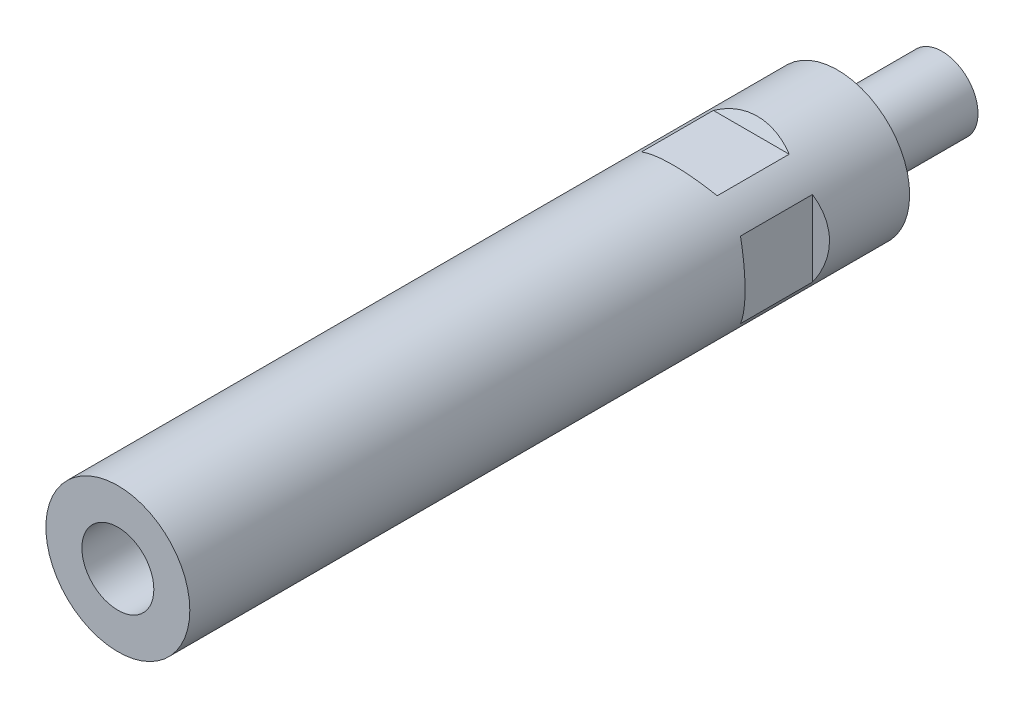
ISO-10303-21;
HEADER;
FILE_DESCRIPTION(('STEP AP214'),'2;1');
FILE_NAME('part.step','',(''),(''),'','','');
FILE_SCHEMA(('AUTOMOTIVE_DESIGN { 1 0 10303 214 1 1 1 1 }'));
ENDSEC;
DATA;
#1=APPLICATION_CONTEXT('core data for automotive mechanical design processes');
#2=APPLICATION_PROTOCOL_DEFINITION('international standard','automotive_design',2000,#1);
#3=PRODUCT_CONTEXT('',#1,'mechanical');
#4=PRODUCT('Part','Part','',(#3));
#5=PRODUCT_RELATED_PRODUCT_CATEGORY('part','',(#4));
#6=PRODUCT_DEFINITION_FORMATION('','',#4);
#7=PRODUCT_DEFINITION_CONTEXT('part definition',#1,'design');
#8=PRODUCT_DEFINITION('design','',#6,#7);
#9=PRODUCT_DEFINITION_SHAPE('','',#8);
#10=(LENGTH_UNIT() NAMED_UNIT(*) SI_UNIT(.MILLI.,.METRE.));
#11=(NAMED_UNIT(*) PLANE_ANGLE_UNIT() SI_UNIT($,.RADIAN.));
#12=(NAMED_UNIT(*) SI_UNIT($,.STERADIAN.) SOLID_ANGLE_UNIT());
#13=UNCERTAINTY_MEASURE_WITH_UNIT(LENGTH_MEASURE(1.E-05),#10,'distance_accuracy_value','');
#14=(GEOMETRIC_REPRESENTATION_CONTEXT(3) GLOBAL_UNCERTAINTY_ASSIGNED_CONTEXT((#13)) GLOBAL_UNIT_ASSIGNED_CONTEXT((#10,
#11,#12)) REPRESENTATION_CONTEXT('',''));
#15=CARTESIAN_POINT('',(0.,0.,0.));
#16=DIRECTION('',(0.,0.,1.));
#17=DIRECTION('',(1.,0.,0.));
#18=AXIS2_PLACEMENT_3D('',#15,#16,#17);
#19=CARTESIAN_POINT('',(0.,0.,5.5));
#20=DIRECTION('',(0.,0.,1.));
#21=DIRECTION('',(0.,-1.,0.));
#22=AXIS2_PLACEMENT_3D('',#19,#20,#21);
#23=CYLINDRICAL_SURFACE('',#22,5.);
#24=CARTESIAN_POINT('',(0.,0.,-14.5));
#25=DIRECTION('',(0.,0.,1.));
#26=DIRECTION('',(0.,-1.,0.));
#27=AXIS2_PLACEMENT_3D('',#24,#25,#26);
#28=CIRCLE('',#27,5.);
#29=CARTESIAN_POINT('',(0.,-5.,-14.5));
#30=VERTEX_POINT('',#29);
#31=EDGE_CURVE('E22',#30,#30,#28,.F.);
#32=ORIENTED_EDGE('',*,*,#31,.F.);
#33=EDGE_LOOP('',(#32));
#34=FACE_BOUND('',#33,.T.);
#35=CARTESIAN_POINT('',(0.,0.,0.));
#36=DIRECTION('',(0.,0.,1.));
#37=DIRECTION('',(1.,0.,0.));
#38=AXIS2_PLACEMENT_3D('',#35,#36,#37);
#39=CIRCLE('',#38,5.);
#40=CARTESIAN_POINT('',(5.,0.,0.));
#41=VERTEX_POINT('',#40);
#42=EDGE_CURVE('E9',#41,#41,#39,.T.);
#43=ORIENTED_EDGE('',*,*,#42,.F.);
#44=EDGE_LOOP('',(#43));
#45=FACE_BOUND('',#44,.T.);
#46=ADVANCED_FACE('F14',(#34,#45),#23,.T.);
#47=CARTESIAN_POINT('',(0.,0.,-14.5));
#48=DIRECTION('',(0.,0.,1.));
#49=DIRECTION('',(0.,-1.,0.));
#50=AXIS2_PLACEMENT_3D('',#47,#48,#49);
#51=PLANE('',#50);
#52=ORIENTED_EDGE('',*,*,#31,.T.);
#53=EDGE_LOOP('',(#52));
#54=FACE_BOUND('',#53,.T.);
#55=ADVANCED_FACE('F16',(#54),#51,.F.);
#56=CARTESIAN_POINT('',(4.25,4.36432032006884E-13,75.));
#57=DIRECTION('',(0.,0.,-1.));
#58=DIRECTION('',(-1.,0.,0.));
#59=AXIS2_PLACEMENT_3D('',#56,#57,#58);
#60=PLANE('',#59);
#61=CARTESIAN_POINT('',(0.,4.36432032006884E-13,75.));
#62=DIRECTION('',(0.,0.,1.));
#63=DIRECTION('',(1.,0.,0.));
#64=AXIS2_PLACEMENT_3D('',#61,#62,#63);
#65=CIRCLE('',#64,5.);
#66=CARTESIAN_POINT('',(5.,4.36432032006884E-13,75.));
#67=VERTEX_POINT('',#66);
#68=EDGE_CURVE('E251',#67,#67,#65,.T.);
#69=ORIENTED_EDGE('',*,*,#68,.T.);
#70=EDGE_LOOP('',(#69));
#71=FACE_BOUND('',#70,.T.);
#72=ADVANCED_FACE('F125',(#71),#60,.F.);
#73=CARTESIAN_POINT('',(0.,4.36432032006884E-13,100.));
#74=DIRECTION('',(0.,0.,1.));
#75=DIRECTION('',(1.,0.,0.));
#76=AXIS2_PLACEMENT_3D('',#73,#74,#75);
#77=CYLINDRICAL_SURFACE('',#76,5.);
#78=ORIENTED_EDGE('',*,*,#68,.F.);
#79=EDGE_LOOP('',(#78));
#80=FACE_BOUND('',#79,.T.);
#81=CARTESIAN_POINT('',(0.,4.36432032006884E-13,100.));
#82=DIRECTION('',(0.,0.,1.));
#83=DIRECTION('',(1.,0.,0.));
#84=AXIS2_PLACEMENT_3D('',#81,#82,#83);
#85=CIRCLE('',#84,5.);
#86=CARTESIAN_POINT('',(5.,4.36432032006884E-13,100.));
#87=VERTEX_POINT('',#86);
#88=EDGE_CURVE('E96',#87,#87,#85,.T.);
#89=ORIENTED_EDGE('',*,*,#88,.T.);
#90=EDGE_LOOP('',(#89));
#91=FACE_BOUND('',#90,.T.);
#92=ADVANCED_FACE('F127',(#80,#91),#77,.F.);
#93=CARTESIAN_POINT('',(0.,0.,100.));
#94=DIRECTION('',(0.,0.,1.));
#95=DIRECTION('',(1.,0.,0.));
#96=AXIS2_PLACEMENT_3D('',#93,#94,#95);
#97=PLANE('',#96);
#98=ORIENTED_EDGE('',*,*,#88,.F.);
#99=EDGE_LOOP('',(#98));
#100=FACE_BOUND('',#99,.T.);
#101=CARTESIAN_POINT('',(0.,0.,100.));
#102=DIRECTION('',(0.,0.,1.));
#103=DIRECTION('',(1.,0.,0.));
#104=AXIS2_PLACEMENT_3D('',#101,#102,#103);
#105=CIRCLE('',#104,10.);
#106=CARTESIAN_POINT('',(10.,0.,100.));
#107=VERTEX_POINT('',#106);
#108=EDGE_CURVE('E239',#107,#107,#105,.T.);
#109=ORIENTED_EDGE('',*,*,#108,.T.);
#110=EDGE_LOOP('',(#109));
#111=FACE_BOUND('',#110,.T.);
#112=ADVANCED_FACE('F134',(#100,#111),#97,.T.);
#113=CARTESIAN_POINT('',(8.5,-10.,22.));
#114=DIRECTION('',(-0.5,0.,0.866025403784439));
#115=DIRECTION('',(0.866025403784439,0.,0.5));
#116=AXIS2_PLACEMENT_3D('',#113,#114,#115);
#117=PLANE('',#116);
#118=DIRECTION('',(0.,1.,0.));
#119=VECTOR('',#118,1.);
#120=CARTESIAN_POINT('',(8.5,-10.,22.));
#121=LINE('',#120,#119);
#122=CARTESIAN_POINT('',(8.5,-5.26782687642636,22.));
#123=VERTEX_POINT('',#122);
#124=CARTESIAN_POINT('',(8.5,5.26782687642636,22.));
#125=VERTEX_POINT('',#124);
#126=EDGE_CURVE('E183',#123,#125,#121,.T.);
#127=ORIENTED_EDGE('',*,*,#126,.T.);
#128=CARTESIAN_POINT('',(0.,0.,17.0925227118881));
#129=DIRECTION('',(-0.5,0.,0.866025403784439));
#130=DIRECTION('',(-0.866025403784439,0.,-0.5));
#131=AXIS2_PLACEMENT_3D('',#128,#129,#130);
#132=ELLIPSE('',#131,11.5470053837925,10.);
#133=EDGE_CURVE('E35',#123,#125,#132,.T.);
#134=ORIENTED_EDGE('',*,*,#133,.F.);
#135=EDGE_LOOP('',(#127,#134));
#136=FACE_BOUND('',#135,.T.);
#137=ADVANCED_FACE('F175',(#136),#117,.F.);
#138=CARTESIAN_POINT('',(8.5,-10.,22.));
#139=DIRECTION('',(-1.,0.,0.));
#140=DIRECTION('',(0.,0.,1.));
#141=AXIS2_PLACEMENT_3D('',#138,#139,#140);
#142=PLANE('',#141);
#143=ORIENTED_EDGE('',*,*,#126,.F.);
#144=DIRECTION('',(0.,0.,-1.));
#145=VECTOR('',#144,1.);
#146=CARTESIAN_POINT('',(8.5,-5.26782687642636,100.));
#147=LINE('',#146,#145);
#148=CARTESIAN_POINT('',(8.5,-5.26782687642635,12.));
#149=VERTEX_POINT('',#148);
#150=EDGE_CURVE('E191',#149,#123,#147,.F.);
#151=ORIENTED_EDGE('',*,*,#150,.F.);
#152=DIRECTION('',(0.,1.,0.));
#153=VECTOR('',#152,1.);
#154=CARTESIAN_POINT('',(8.5,-10.,12.));
#155=LINE('',#154,#153);
#156=CARTESIAN_POINT('',(8.5,5.26782687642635,12.));
#157=VERTEX_POINT('',#156);
#158=EDGE_CURVE('E187',#149,#157,#155,.T.);
#159=ORIENTED_EDGE('',*,*,#158,.T.);
#160=DIRECTION('',(0.,0.,-1.));
#161=VECTOR('',#160,1.);
#162=CARTESIAN_POINT('',(8.5,5.26782687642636,100.));
#163=LINE('',#162,#161);
#164=EDGE_CURVE('E29',#125,#157,#163,.T.);
#165=ORIENTED_EDGE('',*,*,#164,.F.);
#166=EDGE_LOOP('',(#143,#151,#159,#165));
#167=FACE_BOUND('',#166,.T.);
#168=ADVANCED_FACE('F172',(#167),#142,.F.);
#169=CARTESIAN_POINT('',(8.5,-10.,12.));
#170=DIRECTION('',(-0.5,0.,-0.866025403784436));
#171=DIRECTION('',(-0.866025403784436,0.,0.5));
#172=AXIS2_PLACEMENT_3D('',#169,#170,#171);
#173=PLANE('',#172);
#174=CARTESIAN_POINT('',(0.,0.,16.9074772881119));
#175=DIRECTION('',(-0.5,0.,-0.866025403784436));
#176=DIRECTION('',(0.866025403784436,0.,-0.5));
#177=AXIS2_PLACEMENT_3D('',#174,#175,#176);
#178=ELLIPSE('',#177,11.5470053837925,10.);
#179=EDGE_CURVE('E195',#157,#149,#178,.T.);
#180=ORIENTED_EDGE('',*,*,#179,.F.);
#181=ORIENTED_EDGE('',*,*,#158,.F.);
#182=EDGE_LOOP('',(#180,#181));
#183=FACE_BOUND('',#182,.T.);
#184=ADVANCED_FACE('F167',(#183),#173,.F.);
#185=CARTESIAN_POINT('',(-8.5,-10.,12.));
#186=DIRECTION('',(0.5,0.,-0.866025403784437));
#187=DIRECTION('',(-0.866025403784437,0.,-0.5));
#188=AXIS2_PLACEMENT_3D('',#185,#186,#187);
#189=PLANE('',#188);
#190=CARTESIAN_POINT('',(0.,0.,16.9074772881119));
#191=DIRECTION('',(0.5,0.,-0.866025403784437));
#192=DIRECTION('',(-0.866025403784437,0.,-0.5));
#193=AXIS2_PLACEMENT_3D('',#190,#191,#192);
#194=ELLIPSE('',#193,11.5470053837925,10.);
#195=CARTESIAN_POINT('',(-8.5,-5.26782687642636,12.));
#196=VERTEX_POINT('',#195);
#197=CARTESIAN_POINT('',(-8.5,5.26782687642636,12.));
#198=VERTEX_POINT('',#197);
#199=EDGE_CURVE('E193',#196,#198,#194,.T.);
#200=ORIENTED_EDGE('',*,*,#199,.F.);
#201=DIRECTION('',(0.,1.,0.));
#202=VECTOR('',#201,1.);
#203=CARTESIAN_POINT('',(-8.5,-10.,12.));
#204=LINE('',#203,#202);
#205=EDGE_CURVE('E227',#196,#198,#204,.T.);
#206=ORIENTED_EDGE('',*,*,#205,.T.);
#207=EDGE_LOOP('',(#200,#206));
#208=FACE_BOUND('',#207,.T.);
#209=ADVANCED_FACE('F163',(#208),#189,.F.);
#210=CARTESIAN_POINT('',(-8.5,-10.,22.));
#211=DIRECTION('',(0.5,0.,0.866025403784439));
#212=DIRECTION('',(0.866025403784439,0.,-0.5));
#213=AXIS2_PLACEMENT_3D('',#210,#211,#212);
#214=PLANE('',#213);
#215=DIRECTION('',(0.,1.,0.));
#216=VECTOR('',#215,1.);
#217=CARTESIAN_POINT('',(-8.5,-10.,22.));
#218=LINE('',#217,#216);
#219=CARTESIAN_POINT('',(-8.5,-5.26782687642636,22.));
#220=VERTEX_POINT('',#219);
#221=CARTESIAN_POINT('',(-8.5,5.26782687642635,22.));
#222=VERTEX_POINT('',#221);
#223=EDGE_CURVE('E231',#220,#222,#218,.T.);
#224=ORIENTED_EDGE('',*,*,#223,.F.);
#225=CARTESIAN_POINT('',(0.,0.,17.0925227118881));
#226=DIRECTION('',(0.5,0.,0.866025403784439));
#227=DIRECTION('',(0.866025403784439,0.,-0.5));
#228=AXIS2_PLACEMENT_3D('',#225,#226,#227);
#229=ELLIPSE('',#228,11.5470053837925,10.);
#230=EDGE_CURVE('E206',#222,#220,#229,.T.);
#231=ORIENTED_EDGE('',*,*,#230,.F.);
#232=EDGE_LOOP('',(#224,#231));
#233=FACE_BOUND('',#232,.T.);
#234=ADVANCED_FACE('F160',(#233),#214,.F.);
#235=CARTESIAN_POINT('',(-8.5,-10.,22.));
#236=DIRECTION('',(1.,0.,0.));
#237=DIRECTION('',(0.,0.,-1.));
#238=AXIS2_PLACEMENT_3D('',#235,#236,#237);
#239=PLANE('',#238);
#240=ORIENTED_EDGE('',*,*,#223,.T.);
#241=DIRECTION('',(0.,0.,-1.));
#242=VECTOR('',#241,1.);
#243=CARTESIAN_POINT('',(-8.5,5.26782687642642,100.));
#244=LINE('',#243,#242);
#245=EDGE_CURVE('E200',#198,#222,#244,.F.);
#246=ORIENTED_EDGE('',*,*,#245,.F.);
#247=ORIENTED_EDGE('',*,*,#205,.F.);
#248=DIRECTION('',(0.,0.,-1.));
#249=VECTOR('',#248,1.);
#250=CARTESIAN_POINT('',(-8.5,-5.26782687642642,100.));
#251=LINE('',#250,#249);
#252=EDGE_CURVE('E203',#220,#196,#251,.T.);
#253=ORIENTED_EDGE('',*,*,#252,.F.);
#254=EDGE_LOOP('',(#240,#246,#247,#253));
#255=FACE_BOUND('',#254,.T.);
#256=ADVANCED_FACE('F158',(#255),#239,.F.);
#257=CARTESIAN_POINT('',(10.,8.5,22.));
#258=DIRECTION('',(0.,-0.5,0.866025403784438));
#259=DIRECTION('',(0.,-0.866025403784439,-0.5));
#260=AXIS2_PLACEMENT_3D('',#257,#258,#259);
#261=PLANE('',#260);
#262=DIRECTION('',(-1.,0.,0.));
#263=VECTOR('',#262,1.);
#264=CARTESIAN_POINT('',(10.,8.5,22.));
#265=LINE('',#264,#263);
#266=CARTESIAN_POINT('',(5.26782687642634,8.5,22.));
#267=VERTEX_POINT('',#266);
#268=CARTESIAN_POINT('',(-5.26782687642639,8.5,22.));
#269=VERTEX_POINT('',#268);
#270=EDGE_CURVE('E225',#267,#269,#265,.T.);
#271=ORIENTED_EDGE('',*,*,#270,.T.);
#272=CARTESIAN_POINT('',(0.,0.,17.0925227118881));
#273=DIRECTION('',(0.,-0.5,0.866025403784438));
#274=DIRECTION('',(0.,-0.866025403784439,-0.5));
#275=AXIS2_PLACEMENT_3D('',#272,#273,#274);
#276=ELLIPSE('',#275,11.5470053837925,10.);
#277=EDGE_CURVE('E214',#267,#269,#276,.T.);
#278=ORIENTED_EDGE('',*,*,#277,.F.);
#279=EDGE_LOOP('',(#271,#278));
#280=FACE_BOUND('',#279,.T.);
#281=ADVANCED_FACE('F151',(#280),#261,.F.);
#282=CARTESIAN_POINT('',(10.,8.5,22.));
#283=DIRECTION('',(0.,-1.,0.));
#284=DIRECTION('',(1.,0.,0.));
#285=AXIS2_PLACEMENT_3D('',#282,#283,#284);
#286=PLANE('',#285);
#287=ORIENTED_EDGE('',*,*,#270,.F.);
#288=DIRECTION('',(0.,0.,-1.));
#289=VECTOR('',#288,1.);
#290=CARTESIAN_POINT('',(5.26782687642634,8.5,100.));
#291=LINE('',#290,#289);
#292=CARTESIAN_POINT('',(5.26782687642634,8.5,12.));
#293=VERTEX_POINT('',#292);
#294=EDGE_CURVE('E88',#293,#267,#291,.F.);
#295=ORIENTED_EDGE('',*,*,#294,.F.);
#296=DIRECTION('',(-1.,0.,0.));
#297=VECTOR('',#296,1.);
#298=CARTESIAN_POINT('',(10.,8.5,12.));
#299=LINE('',#298,#297);
#300=CARTESIAN_POINT('',(-5.26782687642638,8.5,12.));
#301=VERTEX_POINT('',#300);
#302=EDGE_CURVE('E223',#293,#301,#299,.T.);
#303=ORIENTED_EDGE('',*,*,#302,.T.);
#304=DIRECTION('',(0.,0.,-1.));
#305=VECTOR('',#304,1.);
#306=CARTESIAN_POINT('',(-5.2678268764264,8.5,100.));
#307=LINE('',#306,#305);
#308=EDGE_CURVE('E211',#269,#301,#307,.T.);
#309=ORIENTED_EDGE('',*,*,#308,.F.);
#310=EDGE_LOOP('',(#287,#295,#303,#309));
#311=FACE_BOUND('',#310,.T.);
#312=ADVANCED_FACE('F148',(#311),#286,.F.);
#313=CARTESIAN_POINT('',(10.,8.5,12.));
#314=DIRECTION('',(0.,-0.5,-0.866025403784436));
#315=DIRECTION('',(0.,0.866025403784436,-0.5));
#316=AXIS2_PLACEMENT_3D('',#313,#314,#315);
#317=PLANE('',#316);
#318=CARTESIAN_POINT('',(0.,0.,16.9074772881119));
#319=DIRECTION('',(0.,-0.5,-0.866025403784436));
#320=DIRECTION('',(0.,0.866025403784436,-0.5));
#321=AXIS2_PLACEMENT_3D('',#318,#319,#320);
#322=ELLIPSE('',#321,11.5470053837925,10.);
#323=EDGE_CURVE('E209',#301,#293,#322,.T.);
#324=ORIENTED_EDGE('',*,*,#323,.F.);
#325=ORIENTED_EDGE('',*,*,#302,.F.);
#326=EDGE_LOOP('',(#324,#325));
#327=FACE_BOUND('',#326,.T.);
#328=ADVANCED_FACE('F145',(#327),#317,.F.);
#329=CARTESIAN_POINT('',(10.,-8.5,12.));
#330=DIRECTION('',(0.,0.5,-0.866025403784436));
#331=DIRECTION('',(0.,0.866025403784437,0.5));
#332=AXIS2_PLACEMENT_3D('',#329,#330,#331);
#333=PLANE('',#332);
#334=CARTESIAN_POINT('',(0.,0.,16.9074772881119));
#335=DIRECTION('',(0.,0.5,-0.866025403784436));
#336=DIRECTION('',(0.,-0.866025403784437,-0.5));
#337=AXIS2_PLACEMENT_3D('',#334,#335,#336);
#338=ELLIPSE('',#337,11.5470053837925,10.);
#339=CARTESIAN_POINT('',(5.2678268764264,-8.5,12.));
#340=VERTEX_POINT('',#339);
#341=CARTESIAN_POINT('',(-5.26782687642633,-8.5,12.));
#342=VERTEX_POINT('',#341);
#343=EDGE_CURVE('E79',#340,#342,#338,.T.);
#344=ORIENTED_EDGE('',*,*,#343,.F.);
#345=DIRECTION('',(-1.,0.,0.));
#346=VECTOR('',#345,1.);
#347=CARTESIAN_POINT('',(10.,-8.5,12.));
#348=LINE('',#347,#346);
#349=EDGE_CURVE('E82',#340,#342,#348,.T.);
#350=ORIENTED_EDGE('',*,*,#349,.T.);
#351=EDGE_LOOP('',(#344,#350));
#352=FACE_BOUND('',#351,.T.);
#353=ADVANCED_FACE('F81',(#352),#333,.F.);
#354=CARTESIAN_POINT('',(10.,-8.5,22.));
#355=DIRECTION('',(0.,0.5,0.866025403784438));
#356=DIRECTION('',(0.,-0.866025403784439,0.5));
#357=AXIS2_PLACEMENT_3D('',#354,#355,#356);
#358=PLANE('',#357);
#359=DIRECTION('',(-1.,0.,0.));
#360=VECTOR('',#359,1.);
#361=CARTESIAN_POINT('',(10.,-8.5,22.));
#362=LINE('',#361,#360);
#363=CARTESIAN_POINT('',(5.2678268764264,-8.5,22.));
#364=VERTEX_POINT('',#363);
#365=CARTESIAN_POINT('',(-5.26782687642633,-8.5,22.));
#366=VERTEX_POINT('',#365);
#367=EDGE_CURVE('E95',#364,#366,#362,.T.);
#368=ORIENTED_EDGE('',*,*,#367,.F.);
#369=CARTESIAN_POINT('',(0.,0.,17.0925227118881));
#370=DIRECTION('',(0.,0.5,0.866025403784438));
#371=DIRECTION('',(0.,0.866025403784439,-0.5));
#372=AXIS2_PLACEMENT_3D('',#369,#370,#371);
#373=ELLIPSE('',#372,11.5470053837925,10.);
#374=EDGE_CURVE('E101',#366,#364,#373,.T.);
#375=ORIENTED_EDGE('',*,*,#374,.F.);
#376=EDGE_LOOP('',(#368,#375));
#377=FACE_BOUND('',#376,.T.);
#378=ADVANCED_FACE('F139',(#377),#358,.F.);
#379=CARTESIAN_POINT('',(10.,-8.5,22.));
#380=DIRECTION('',(0.,1.,0.));
#381=DIRECTION('',(-1.,0.,0.));
#382=AXIS2_PLACEMENT_3D('',#379,#380,#381);
#383=PLANE('',#382);
#384=ORIENTED_EDGE('',*,*,#367,.T.);
#385=DIRECTION('',(0.,0.,-1.));
#386=VECTOR('',#385,1.);
#387=CARTESIAN_POINT('',(-5.26782687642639,-8.5,100.));
#388=LINE('',#387,#386);
#389=EDGE_CURVE('E87',#342,#366,#388,.F.);
#390=ORIENTED_EDGE('',*,*,#389,.F.);
#391=ORIENTED_EDGE('',*,*,#349,.F.);
#392=DIRECTION('',(0.,0.,-1.));
#393=VECTOR('',#392,1.);
#394=CARTESIAN_POINT('',(5.26782687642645,-8.5,100.));
#395=LINE('',#394,#393);
#396=EDGE_CURVE('E93',#364,#340,#395,.T.);
#397=ORIENTED_EDGE('',*,*,#396,.F.);
#398=EDGE_LOOP('',(#384,#390,#391,#397));
#399=FACE_BOUND('',#398,.T.);
#400=ADVANCED_FACE('F92',(#399),#383,.F.);
#401=CARTESIAN_POINT('',(0.,0.,100.));
#402=DIRECTION('',(0.,0.,-1.));
#403=DIRECTION('',(-1.,0.,0.));
#404=AXIS2_PLACEMENT_3D('',#401,#402,#403);
#405=CYLINDRICAL_SURFACE('',#404,10.);
#406=ORIENTED_EDGE('',*,*,#389,.T.);
#407=ORIENTED_EDGE('',*,*,#374,.T.);
#408=ORIENTED_EDGE('',*,*,#396,.T.);
#409=ORIENTED_EDGE('',*,*,#343,.T.);
#410=EDGE_LOOP('',(#406,#407,#408,#409));
#411=FACE_BOUND('',#410,.T.);
#412=ORIENTED_EDGE('',*,*,#323,.T.);
#413=ORIENTED_EDGE('',*,*,#294,.T.);
#414=ORIENTED_EDGE('',*,*,#277,.T.);
#415=ORIENTED_EDGE('',*,*,#308,.T.);
#416=EDGE_LOOP('',(#412,#413,#414,#415));
#417=FACE_BOUND('',#416,.T.);
#418=ORIENTED_EDGE('',*,*,#245,.T.);
#419=ORIENTED_EDGE('',*,*,#230,.T.);
#420=ORIENTED_EDGE('',*,*,#252,.T.);
#421=ORIENTED_EDGE('',*,*,#199,.T.);
#422=EDGE_LOOP('',(#418,#419,#420,#421));
#423=FACE_BOUND('',#422,.T.);
#424=ORIENTED_EDGE('',*,*,#179,.T.);
#425=ORIENTED_EDGE('',*,*,#150,.T.);
#426=ORIENTED_EDGE('',*,*,#133,.T.);
#427=ORIENTED_EDGE('',*,*,#164,.T.);
#428=EDGE_LOOP('',(#424,#425,#426,#427));
#429=FACE_BOUND('',#428,.T.);
#430=ORIENTED_EDGE('',*,*,#108,.F.);
#431=EDGE_LOOP('',(#430));
#432=FACE_BOUND('',#431,.T.);
#433=CARTESIAN_POINT('',(0.,0.,0.));
#434=DIRECTION('',(0.,0.,1.));
#435=DIRECTION('',(1.,0.,0.));
#436=AXIS2_PLACEMENT_3D('',#433,#434,#435);
#437=CIRCLE('',#436,10.);
#438=CARTESIAN_POINT('',(10.,0.,0.));
#439=VERTEX_POINT('',#438);
#440=EDGE_CURVE('E186',#439,#439,#437,.T.);
#441=ORIENTED_EDGE('',*,*,#440,.T.);
#442=EDGE_LOOP('',(#441));
#443=FACE_BOUND('',#442,.T.);
#444=ADVANCED_FACE('F99',(#411,#417,#423,#429,#432,#443),#405,.T.);
#445=CARTESIAN_POINT('',(0.,0.,0.));
#446=DIRECTION('',(0.,0.,1.));
#447=DIRECTION('',(1.,0.,0.));
#448=AXIS2_PLACEMENT_3D('',#445,#446,#447);
#449=PLANE('',#448);
#450=ORIENTED_EDGE('',*,*,#440,.F.);
#451=EDGE_LOOP('',(#450));
#452=FACE_BOUND('',#451,.T.);
#453=ORIENTED_EDGE('',*,*,#42,.T.);
#454=EDGE_LOOP('',(#453));
#455=FACE_BOUND('',#454,.T.);
#456=ADVANCED_FACE('F111',(#452,#455),#449,.F.);
#457=CLOSED_SHELL('',(#46,#55,#72,#92,#112,#137,#168,#184,#209,#234,#256,#281,#312,#328,#353,
#378,#400,#444,#456));
#458=MANIFOLD_SOLID_BREP('B1',#457);
#459=ADVANCED_BREP_SHAPE_REPRESENTATION('',(#18,#458),#14);
#460=SHAPE_DEFINITION_REPRESENTATION(#9,#459);
ENDSEC;
END-ISO-10303-21;
